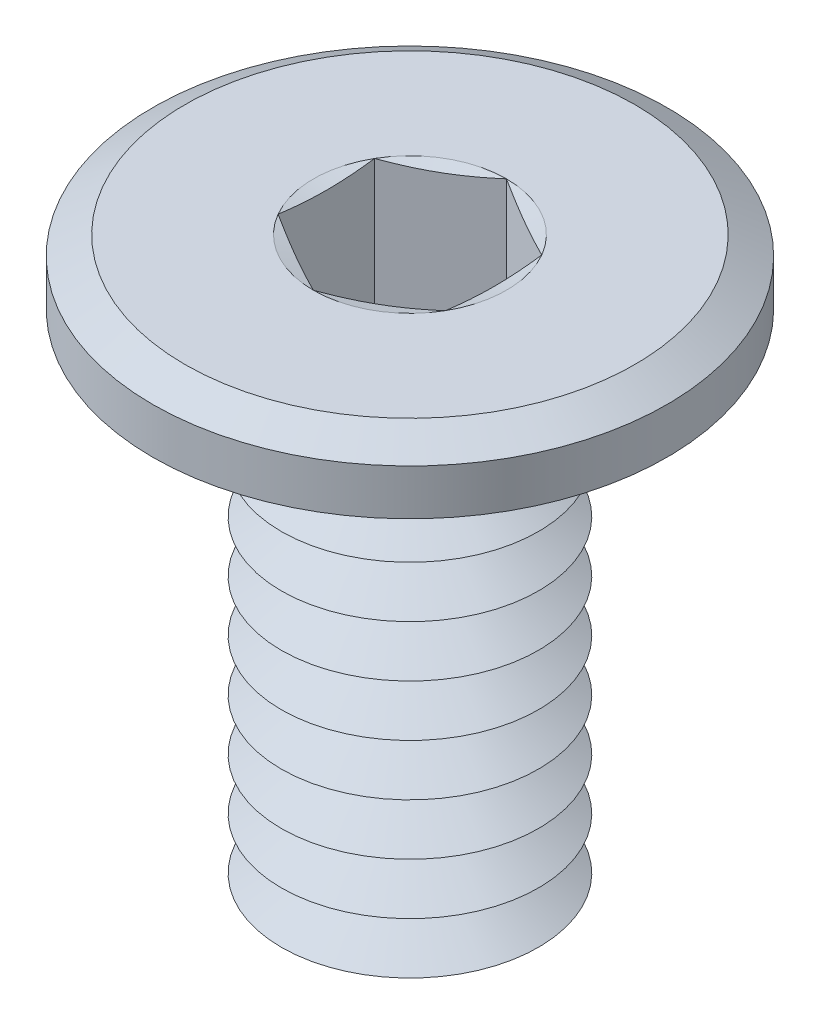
ISO-10303-21;
HEADER;
FILE_DESCRIPTION(('STEP AP214'),'2;1');
FILE_NAME('part.step','',(''),(''),'','','');
FILE_SCHEMA(('AUTOMOTIVE_DESIGN { 1 0 10303 214 1 1 1 1 }'));
ENDSEC;
DATA;
#1=APPLICATION_CONTEXT('core data for automotive mechanical design processes');
#2=APPLICATION_PROTOCOL_DEFINITION('international standard','automotive_design',2000,#1);
#3=PRODUCT_CONTEXT('',#1,'mechanical');
#4=PRODUCT('Part','Part','',(#3));
#5=PRODUCT_RELATED_PRODUCT_CATEGORY('part','',(#4));
#6=PRODUCT_DEFINITION_FORMATION('','',#4);
#7=PRODUCT_DEFINITION_CONTEXT('part definition',#1,'design');
#8=PRODUCT_DEFINITION('design','',#6,#7);
#9=PRODUCT_DEFINITION_SHAPE('','',#8);
#10=(LENGTH_UNIT() NAMED_UNIT(*) SI_UNIT(.MILLI.,.METRE.));
#11=(NAMED_UNIT(*) PLANE_ANGLE_UNIT() SI_UNIT($,.RADIAN.));
#12=(NAMED_UNIT(*) SI_UNIT($,.STERADIAN.) SOLID_ANGLE_UNIT());
#13=UNCERTAINTY_MEASURE_WITH_UNIT(LENGTH_MEASURE(1.E-05),#10,'distance_accuracy_value','');
#14=(GEOMETRIC_REPRESENTATION_CONTEXT(3) GLOBAL_UNCERTAINTY_ASSIGNED_CONTEXT((#13)) GLOBAL_UNIT_ASSIGNED_CONTEXT((#10,
#11,#12)) REPRESENTATION_CONTEXT('',''));
#15=CARTESIAN_POINT('',(0.,0.,0.));
#16=DIRECTION('',(0.,0.,1.));
#17=DIRECTION('',(1.,0.,0.));
#18=AXIS2_PLACEMENT_3D('',#15,#16,#17);
#19=CARTESIAN_POINT('',(0.,-3.9,0.));
#20=DIRECTION('',(0.,-1.,0.));
#21=DIRECTION('',(0.,0.,-1.));
#22=AXIS2_PLACEMENT_3D('',#19,#20,#21);
#23=CONICAL_SURFACE('',#22,1.,1.0471975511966);
#24=CARTESIAN_POINT('',(0.,-3.7,0.));
#25=DIRECTION('',(0.,1.,0.));
#26=DIRECTION('',(0.,0.,1.));
#27=AXIS2_PLACEMENT_3D('',#24,#25,#26);
#28=CIRCLE('',#27,0.653589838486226);
#29=CARTESIAN_POINT('',(0.,-3.7,0.653589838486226));
#30=VERTEX_POINT('',#29);
#31=EDGE_CURVE('E425',#30,#30,#28,.T.);
#32=ORIENTED_EDGE('',*,*,#31,.F.);
#33=EDGE_LOOP('',(#32));
#34=FACE_BOUND('',#33,.T.);
#35=CARTESIAN_POINT('',(0.,-3.9,0.));
#36=DIRECTION('',(0.,1.,0.));
#37=DIRECTION('',(0.,0.,1.));
#38=AXIS2_PLACEMENT_3D('',#35,#36,#37);
#39=CIRCLE('',#38,1.);
#40=CARTESIAN_POINT('',(0.,-3.9,1.));
#41=VERTEX_POINT('',#40);
#42=EDGE_CURVE('E428',#41,#41,#39,.T.);
#43=ORIENTED_EDGE('',*,*,#42,.T.);
#44=EDGE_LOOP('',(#43));
#45=FACE_BOUND('',#44,.T.);
#46=ADVANCED_FACE('F39',(#34,#45),#23,.T.);
#47=CARTESIAN_POINT('',(0.,-3.7,0.));
#48=DIRECTION('',(0.,1.,0.));
#49=DIRECTION('',(0.,0.,1.));
#50=AXIS2_PLACEMENT_3D('',#47,#48,#49);
#51=CONICAL_SURFACE('',#50,0.653589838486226,1.0471975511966);
#52=CARTESIAN_POINT('',(0.,-3.5,0.));
#53=DIRECTION('',(0.,1.,0.));
#54=DIRECTION('',(0.,0.,1.));
#55=AXIS2_PLACEMENT_3D('',#52,#53,#54);
#56=CIRCLE('',#55,1.);
#57=CARTESIAN_POINT('',(0.,-3.5,1.));
#58=VERTEX_POINT('',#57);
#59=EDGE_CURVE('E421',#58,#58,#56,.T.);
#60=ORIENTED_EDGE('',*,*,#59,.F.);
#61=EDGE_LOOP('',(#60));
#62=FACE_BOUND('',#61,.T.);
#63=ORIENTED_EDGE('',*,*,#31,.T.);
#64=EDGE_LOOP('',(#63));
#65=FACE_BOUND('',#64,.T.);
#66=ADVANCED_FACE('F233',(#62,#65),#51,.T.);
#67=CARTESIAN_POINT('',(0.,-4.5,0.));
#68=DIRECTION('',(0.,-1.,0.));
#69=DIRECTION('',(0.,0.,-1.));
#70=AXIS2_PLACEMENT_3D('',#67,#68,#69);
#71=PLANE('',#70);
#72=CARTESIAN_POINT('',(0.,-4.5,0.));
#73=DIRECTION('',(0.,1.,0.));
#74=DIRECTION('',(0.,0.,1.));
#75=AXIS2_PLACEMENT_3D('',#72,#73,#74);
#76=CIRCLE('',#75,0.653589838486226);
#77=CARTESIAN_POINT('',(0.,-4.5,0.653589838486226));
#78=VERTEX_POINT('',#77);
#79=EDGE_CURVE('E299',#78,#78,#76,.T.);
#80=ORIENTED_EDGE('',*,*,#79,.F.);
#81=EDGE_LOOP('',(#80));
#82=FACE_BOUND('',#81,.T.);
#83=ADVANCED_FACE('F239',(#82),#71,.T.);
#84=CARTESIAN_POINT('',(0.,-4.5,0.));
#85=DIRECTION('',(0.,1.,0.));
#86=DIRECTION('',(0.,0.,1.));
#87=AXIS2_PLACEMENT_3D('',#84,#85,#86);
#88=CONICAL_SURFACE('',#87,0.653589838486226,1.0471975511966);
#89=CARTESIAN_POINT('',(0.,-4.3,0.));
#90=DIRECTION('',(0.,1.,0.));
#91=DIRECTION('',(0.,0.,1.));
#92=AXIS2_PLACEMENT_3D('',#89,#90,#91);
#93=CIRCLE('',#92,1.);
#94=CARTESIAN_POINT('',(0.,-4.3,1.));
#95=VERTEX_POINT('',#94);
#96=EDGE_CURVE('E436',#95,#95,#93,.T.);
#97=ORIENTED_EDGE('',*,*,#96,.F.);
#98=EDGE_LOOP('',(#97));
#99=FACE_BOUND('',#98,.T.);
#100=ORIENTED_EDGE('',*,*,#79,.T.);
#101=EDGE_LOOP('',(#100));
#102=FACE_BOUND('',#101,.T.);
#103=ADVANCED_FACE('F254',(#99,#102),#88,.T.);
#104=CARTESIAN_POINT('',(0.,-4.3,0.));
#105=DIRECTION('',(0.,-1.,0.));
#106=DIRECTION('',(0.,0.,-1.));
#107=AXIS2_PLACEMENT_3D('',#104,#105,#106);
#108=CONICAL_SURFACE('',#107,1.,1.0471975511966);
#109=CARTESIAN_POINT('',(0.,-4.1,0.));
#110=DIRECTION('',(0.,1.,0.));
#111=DIRECTION('',(0.,0.,1.));
#112=AXIS2_PLACEMENT_3D('',#109,#110,#111);
#113=CIRCLE('',#112,0.653589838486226);
#114=CARTESIAN_POINT('',(0.,-4.1,0.653589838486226));
#115=VERTEX_POINT('',#114);
#116=EDGE_CURVE('E432',#115,#115,#113,.T.);
#117=ORIENTED_EDGE('',*,*,#116,.F.);
#118=EDGE_LOOP('',(#117));
#119=FACE_BOUND('',#118,.T.);
#120=ORIENTED_EDGE('',*,*,#96,.T.);
#121=EDGE_LOOP('',(#120));
#122=FACE_BOUND('',#121,.T.);
#123=ADVANCED_FACE('F250',(#119,#122),#108,.T.);
#124=CARTESIAN_POINT('',(0.,-4.1,0.));
#125=DIRECTION('',(0.,1.,0.));
#126=DIRECTION('',(0.,0.,1.));
#127=AXIS2_PLACEMENT_3D('',#124,#125,#126);
#128=CONICAL_SURFACE('',#127,0.653589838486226,1.0471975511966);
#129=ORIENTED_EDGE('',*,*,#42,.F.);
#130=EDGE_LOOP('',(#129));
#131=FACE_BOUND('',#130,.T.);
#132=ORIENTED_EDGE('',*,*,#116,.T.);
#133=EDGE_LOOP('',(#132));
#134=FACE_BOUND('',#133,.T.);
#135=ADVANCED_FACE('F246',(#131,#134),#128,.T.);
#136=CARTESIAN_POINT('',(0.,-3.5,0.));
#137=DIRECTION('',(0.,-1.,0.));
#138=DIRECTION('',(0.,0.,-1.));
#139=AXIS2_PLACEMENT_3D('',#136,#137,#138);
#140=CONICAL_SURFACE('',#139,1.,1.0471975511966);
#141=CARTESIAN_POINT('',(0.,-3.3,0.));
#142=DIRECTION('',(0.,1.,0.));
#143=DIRECTION('',(0.,0.,1.));
#144=AXIS2_PLACEMENT_3D('',#141,#142,#143);
#145=CIRCLE('',#144,0.653589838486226);
#146=CARTESIAN_POINT('',(0.,-3.3,0.653589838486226));
#147=VERTEX_POINT('',#146);
#148=EDGE_CURVE('E417',#147,#147,#145,.T.);
#149=ORIENTED_EDGE('',*,*,#148,.F.);
#150=EDGE_LOOP('',(#149));
#151=FACE_BOUND('',#150,.T.);
#152=ORIENTED_EDGE('',*,*,#59,.T.);
#153=EDGE_LOOP('',(#152));
#154=FACE_BOUND('',#153,.T.);
#155=ADVANCED_FACE('F249',(#151,#154),#140,.T.);
#156=CARTESIAN_POINT('',(0.,-3.3,0.));
#157=DIRECTION('',(0.,1.,0.));
#158=DIRECTION('',(0.,0.,1.));
#159=AXIS2_PLACEMENT_3D('',#156,#157,#158);
#160=CONICAL_SURFACE('',#159,0.653589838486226,1.0471975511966);
#161=CARTESIAN_POINT('',(0.,-3.1,0.));
#162=DIRECTION('',(0.,1.,0.));
#163=DIRECTION('',(0.,0.,1.));
#164=AXIS2_PLACEMENT_3D('',#161,#162,#163);
#165=CIRCLE('',#164,1.);
#166=CARTESIAN_POINT('',(0.,-3.1,1.));
#167=VERTEX_POINT('',#166);
#168=EDGE_CURVE('E413',#167,#167,#165,.T.);
#169=ORIENTED_EDGE('',*,*,#168,.F.);
#170=EDGE_LOOP('',(#169));
#171=FACE_BOUND('',#170,.T.);
#172=ORIENTED_EDGE('',*,*,#148,.T.);
#173=EDGE_LOOP('',(#172));
#174=FACE_BOUND('',#173,.T.);
#175=ADVANCED_FACE('F640',(#171,#174),#160,.T.);
#176=CARTESIAN_POINT('',(0.,-3.1,0.));
#177=DIRECTION('',(0.,-1.,0.));
#178=DIRECTION('',(0.,0.,-1.));
#179=AXIS2_PLACEMENT_3D('',#176,#177,#178);
#180=CONICAL_SURFACE('',#179,1.,1.0471975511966);
#181=CARTESIAN_POINT('',(0.,-2.9,0.));
#182=DIRECTION('',(0.,1.,0.));
#183=DIRECTION('',(0.,0.,1.));
#184=AXIS2_PLACEMENT_3D('',#181,#182,#183);
#185=CIRCLE('',#184,0.653589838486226);
#186=CARTESIAN_POINT('',(0.,-2.9,0.653589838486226));
#187=VERTEX_POINT('',#186);
#188=EDGE_CURVE('E409',#187,#187,#185,.T.);
#189=ORIENTED_EDGE('',*,*,#188,.F.);
#190=EDGE_LOOP('',(#189));
#191=FACE_BOUND('',#190,.T.);
#192=ORIENTED_EDGE('',*,*,#168,.T.);
#193=EDGE_LOOP('',(#192));
#194=FACE_BOUND('',#193,.T.);
#195=ADVANCED_FACE('F631',(#191,#194),#180,.T.);
#196=CARTESIAN_POINT('',(0.,-2.9,0.));
#197=DIRECTION('',(0.,1.,0.));
#198=DIRECTION('',(0.,0.,1.));
#199=AXIS2_PLACEMENT_3D('',#196,#197,#198);
#200=CONICAL_SURFACE('',#199,0.653589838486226,1.0471975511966);
#201=CARTESIAN_POINT('',(0.,-2.7,0.));
#202=DIRECTION('',(0.,1.,0.));
#203=DIRECTION('',(0.,0.,1.));
#204=AXIS2_PLACEMENT_3D('',#201,#202,#203);
#205=CIRCLE('',#204,1.);
#206=CARTESIAN_POINT('',(0.,-2.7,1.));
#207=VERTEX_POINT('',#206);
#208=EDGE_CURVE('E405',#207,#207,#205,.T.);
#209=ORIENTED_EDGE('',*,*,#208,.F.);
#210=EDGE_LOOP('',(#209));
#211=FACE_BOUND('',#210,.T.);
#212=ORIENTED_EDGE('',*,*,#188,.T.);
#213=EDGE_LOOP('',(#212));
#214=FACE_BOUND('',#213,.T.);
#215=ADVANCED_FACE('F622',(#211,#214),#200,.T.);
#216=CARTESIAN_POINT('',(0.,-2.7,0.));
#217=DIRECTION('',(0.,-1.,0.));
#218=DIRECTION('',(0.,0.,-1.));
#219=AXIS2_PLACEMENT_3D('',#216,#217,#218);
#220=CONICAL_SURFACE('',#219,1.,1.0471975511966);
#221=CARTESIAN_POINT('',(0.,-2.5,0.));
#222=DIRECTION('',(0.,1.,0.));
#223=DIRECTION('',(0.,0.,1.));
#224=AXIS2_PLACEMENT_3D('',#221,#222,#223);
#225=CIRCLE('',#224,0.653589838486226);
#226=CARTESIAN_POINT('',(0.,-2.5,0.653589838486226));
#227=VERTEX_POINT('',#226);
#228=EDGE_CURVE('E401',#227,#227,#225,.T.);
#229=ORIENTED_EDGE('',*,*,#228,.F.);
#230=EDGE_LOOP('',(#229));
#231=FACE_BOUND('',#230,.T.);
#232=ORIENTED_EDGE('',*,*,#208,.T.);
#233=EDGE_LOOP('',(#232));
#234=FACE_BOUND('',#233,.T.);
#235=ADVANCED_FACE('F613',(#231,#234),#220,.T.);
#236=CARTESIAN_POINT('',(0.,-2.5,0.));
#237=DIRECTION('',(0.,1.,0.));
#238=DIRECTION('',(0.,0.,1.));
#239=AXIS2_PLACEMENT_3D('',#236,#237,#238);
#240=CONICAL_SURFACE('',#239,0.653589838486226,1.0471975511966);
#241=CARTESIAN_POINT('',(0.,-2.3,0.));
#242=DIRECTION('',(0.,1.,0.));
#243=DIRECTION('',(0.,0.,1.));
#244=AXIS2_PLACEMENT_3D('',#241,#242,#243);
#245=CIRCLE('',#244,1.);
#246=CARTESIAN_POINT('',(0.,-2.3,1.));
#247=VERTEX_POINT('',#246);
#248=EDGE_CURVE('E398',#247,#247,#245,.T.);
#249=ORIENTED_EDGE('',*,*,#248,.F.);
#250=EDGE_LOOP('',(#249));
#251=FACE_BOUND('',#250,.T.);
#252=ORIENTED_EDGE('',*,*,#228,.T.);
#253=EDGE_LOOP('',(#252));
#254=FACE_BOUND('',#253,.T.);
#255=ADVANCED_FACE('F604',(#251,#254),#240,.T.);
#256=CARTESIAN_POINT('',(0.,-2.3,0.));
#257=DIRECTION('',(0.,-1.,0.));
#258=DIRECTION('',(0.,0.,-1.));
#259=AXIS2_PLACEMENT_3D('',#256,#257,#258);
#260=CONICAL_SURFACE('',#259,1.,1.0471975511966);
#261=CARTESIAN_POINT('',(0.,-2.1,0.));
#262=DIRECTION('',(0.,1.,0.));
#263=DIRECTION('',(0.,0.,1.));
#264=AXIS2_PLACEMENT_3D('',#261,#262,#263);
#265=CIRCLE('',#264,0.653589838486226);
#266=CARTESIAN_POINT('',(0.,-2.1,0.653589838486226));
#267=VERTEX_POINT('',#266);
#268=EDGE_CURVE('E394',#267,#267,#265,.T.);
#269=ORIENTED_EDGE('',*,*,#268,.F.);
#270=EDGE_LOOP('',(#269));
#271=FACE_BOUND('',#270,.T.);
#272=ORIENTED_EDGE('',*,*,#248,.T.);
#273=EDGE_LOOP('',(#272));
#274=FACE_BOUND('',#273,.T.);
#275=ADVANCED_FACE('F595',(#271,#274),#260,.T.);
#276=CARTESIAN_POINT('',(0.,-2.1,0.));
#277=DIRECTION('',(0.,1.,0.));
#278=DIRECTION('',(0.,0.,1.));
#279=AXIS2_PLACEMENT_3D('',#276,#277,#278);
#280=CONICAL_SURFACE('',#279,0.653589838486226,1.0471975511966);
#281=CARTESIAN_POINT('',(0.,-1.9,0.));
#282=DIRECTION('',(0.,1.,0.));
#283=DIRECTION('',(0.,0.,1.));
#284=AXIS2_PLACEMENT_3D('',#281,#282,#283);
#285=CIRCLE('',#284,1.);
#286=CARTESIAN_POINT('',(0.,-1.9,1.));
#287=VERTEX_POINT('',#286);
#288=EDGE_CURVE('E390',#287,#287,#285,.T.);
#289=ORIENTED_EDGE('',*,*,#288,.F.);
#290=EDGE_LOOP('',(#289));
#291=FACE_BOUND('',#290,.T.);
#292=ORIENTED_EDGE('',*,*,#268,.T.);
#293=EDGE_LOOP('',(#292));
#294=FACE_BOUND('',#293,.T.);
#295=ADVANCED_FACE('F586',(#291,#294),#280,.T.);
#296=CARTESIAN_POINT('',(0.,-1.9,0.));
#297=DIRECTION('',(0.,-1.,0.));
#298=DIRECTION('',(0.,0.,-1.));
#299=AXIS2_PLACEMENT_3D('',#296,#297,#298);
#300=CONICAL_SURFACE('',#299,1.,1.0471975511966);
#301=CARTESIAN_POINT('',(0.,-1.7,0.));
#302=DIRECTION('',(0.,1.,0.));
#303=DIRECTION('',(0.,0.,1.));
#304=AXIS2_PLACEMENT_3D('',#301,#302,#303);
#305=CIRCLE('',#304,0.653589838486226);
#306=CARTESIAN_POINT('',(0.,-1.7,0.653589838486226));
#307=VERTEX_POINT('',#306);
#308=EDGE_CURVE('E386',#307,#307,#305,.T.);
#309=ORIENTED_EDGE('',*,*,#308,.F.);
#310=EDGE_LOOP('',(#309));
#311=FACE_BOUND('',#310,.T.);
#312=ORIENTED_EDGE('',*,*,#288,.T.);
#313=EDGE_LOOP('',(#312));
#314=FACE_BOUND('',#313,.T.);
#315=ADVANCED_FACE('F577',(#311,#314),#300,.T.);
#316=CARTESIAN_POINT('',(0.,-1.7,0.));
#317=DIRECTION('',(0.,1.,0.));
#318=DIRECTION('',(0.,0.,1.));
#319=AXIS2_PLACEMENT_3D('',#316,#317,#318);
#320=CONICAL_SURFACE('',#319,0.653589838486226,1.0471975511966);
#321=CARTESIAN_POINT('',(0.,-1.5,0.));
#322=DIRECTION('',(0.,1.,0.));
#323=DIRECTION('',(0.,0.,1.));
#324=AXIS2_PLACEMENT_3D('',#321,#322,#323);
#325=CIRCLE('',#324,1.);
#326=CARTESIAN_POINT('',(0.,-1.5,1.));
#327=VERTEX_POINT('',#326);
#328=EDGE_CURVE('E382',#327,#327,#325,.T.);
#329=ORIENTED_EDGE('',*,*,#328,.F.);
#330=EDGE_LOOP('',(#329));
#331=FACE_BOUND('',#330,.T.);
#332=ORIENTED_EDGE('',*,*,#308,.T.);
#333=EDGE_LOOP('',(#332));
#334=FACE_BOUND('',#333,.T.);
#335=ADVANCED_FACE('F568',(#331,#334),#320,.T.);
#336=CARTESIAN_POINT('',(0.,-1.5,0.));
#337=DIRECTION('',(0.,-1.,0.));
#338=DIRECTION('',(0.,0.,-1.));
#339=AXIS2_PLACEMENT_3D('',#336,#337,#338);
#340=CONICAL_SURFACE('',#339,1.,1.0471975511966);
#341=CARTESIAN_POINT('',(0.,-1.3,0.));
#342=DIRECTION('',(0.,1.,0.));
#343=DIRECTION('',(0.,0.,1.));
#344=AXIS2_PLACEMENT_3D('',#341,#342,#343);
#345=CIRCLE('',#344,0.653589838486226);
#346=CARTESIAN_POINT('',(0.,-1.3,0.653589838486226));
#347=VERTEX_POINT('',#346);
#348=EDGE_CURVE('E378',#347,#347,#345,.T.);
#349=ORIENTED_EDGE('',*,*,#348,.F.);
#350=EDGE_LOOP('',(#349));
#351=FACE_BOUND('',#350,.T.);
#352=ORIENTED_EDGE('',*,*,#328,.T.);
#353=EDGE_LOOP('',(#352));
#354=FACE_BOUND('',#353,.T.);
#355=ADVANCED_FACE('F559',(#351,#354),#340,.T.);
#356=CARTESIAN_POINT('',(0.,-1.3,0.));
#357=DIRECTION('',(0.,1.,0.));
#358=DIRECTION('',(0.,0.,1.));
#359=AXIS2_PLACEMENT_3D('',#356,#357,#358);
#360=CONICAL_SURFACE('',#359,0.653589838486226,1.0471975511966);
#361=CARTESIAN_POINT('',(0.,-1.1,0.));
#362=DIRECTION('',(0.,1.,0.));
#363=DIRECTION('',(0.,0.,1.));
#364=AXIS2_PLACEMENT_3D('',#361,#362,#363);
#365=CIRCLE('',#364,1.);
#366=CARTESIAN_POINT('',(0.,-1.1,1.));
#367=VERTEX_POINT('',#366);
#368=EDGE_CURVE('E362',#367,#367,#365,.T.);
#369=ORIENTED_EDGE('',*,*,#368,.F.);
#370=EDGE_LOOP('',(#369));
#371=FACE_BOUND('',#370,.T.);
#372=ORIENTED_EDGE('',*,*,#348,.T.);
#373=EDGE_LOOP('',(#372));
#374=FACE_BOUND('',#373,.T.);
#375=ADVANCED_FACE('F274',(#371,#374),#360,.T.);
#376=CARTESIAN_POINT('',(0.,0.,0.));
#377=DIRECTION('',(0.,1.,0.));
#378=DIRECTION('',(0.,0.,1.));
#379=AXIS2_PLACEMENT_3D('',#376,#377,#378);
#380=PLANE('',#379);
#381=CARTESIAN_POINT('',(0.,0.,0.));
#382=DIRECTION('',(0.,1.,0.));
#383=DIRECTION('',(0.,0.,1.));
#384=AXIS2_PLACEMENT_3D('',#381,#382,#383);
#385=CIRCLE('',#384,0.750555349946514);
#386=CARTESIAN_POINT('',(0.,0.,0.750555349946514));
#387=VERTEX_POINT('',#386);
#388=CARTESIAN_POINT('',(0.65,0.,0.375277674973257));
#389=VERTEX_POINT('',#388);
#390=EDGE_CURVE('E66',#387,#389,#385,.T.);
#391=ORIENTED_EDGE('',*,*,#390,.F.);
#392=CARTESIAN_POINT('',(-0.65,0.,0.375277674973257));
#393=VERTEX_POINT('',#392);
#394=EDGE_CURVE('E169',#393,#387,#385,.T.);
#395=ORIENTED_EDGE('',*,*,#394,.F.);
#396=CARTESIAN_POINT('',(-0.65,0.,-0.375277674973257));
#397=VERTEX_POINT('',#396);
#398=EDGE_CURVE('E164',#397,#393,#385,.T.);
#399=ORIENTED_EDGE('',*,*,#398,.F.);
#400=CARTESIAN_POINT('',(0.,0.,-0.750555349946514));
#401=VERTEX_POINT('',#400);
#402=EDGE_CURVE('E128',#401,#397,#385,.T.);
#403=ORIENTED_EDGE('',*,*,#402,.F.);
#404=CARTESIAN_POINT('',(0.65,0.,-0.375277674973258));
#405=VERTEX_POINT('',#404);
#406=EDGE_CURVE('E119',#405,#401,#385,.T.);
#407=ORIENTED_EDGE('',*,*,#406,.F.);
#408=EDGE_CURVE('E59',#389,#405,#385,.T.);
#409=ORIENTED_EDGE('',*,*,#408,.F.);
#410=EDGE_LOOP('',(#391,#395,#399,#403,#407,#409));
#411=FACE_BOUND('',#410,.T.);
#412=CARTESIAN_POINT('',(0.,0.,0.));
#413=DIRECTION('',(0.,1.,0.));
#414=DIRECTION('',(0.,0.,1.));
#415=AXIS2_PLACEMENT_3D('',#412,#413,#414);
#416=CIRCLE('',#415,1.75);
#417=CARTESIAN_POINT('',(0.,0.,1.75));
#418=VERTEX_POINT('',#417);
#419=EDGE_CURVE('E295',#418,#418,#416,.T.);
#420=ORIENTED_EDGE('',*,*,#419,.T.);
#421=EDGE_LOOP('',(#420));
#422=FACE_BOUND('',#421,.T.);
#423=ADVANCED_FACE('F160',(#411,#422),#380,.T.);
#424=CARTESIAN_POINT('',(0.,-0.5,0.));
#425=DIRECTION('',(0.,1.,0.));
#426=DIRECTION('',(0.,0.,1.));
#427=AXIS2_PLACEMENT_3D('',#424,#425,#426);
#428=CYLINDRICAL_SURFACE('',#427,2.);
#429=CARTESIAN_POINT('',(0.,-0.144337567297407,0.));
#430=DIRECTION('',(0.,1.,0.));
#431=DIRECTION('',(0.,0.,1.));
#432=AXIS2_PLACEMENT_3D('',#429,#430,#431);
#433=CIRCLE('',#432,2.);
#434=CARTESIAN_POINT('',(0.,-0.144337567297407,2.));
#435=VERTEX_POINT('',#434);
#436=EDGE_CURVE('E306',#435,#435,#433,.F.);
#437=ORIENTED_EDGE('',*,*,#436,.T.);
#438=EDGE_LOOP('',(#437));
#439=FACE_BOUND('',#438,.T.);
#440=CARTESIAN_POINT('',(0.,-0.5,0.));
#441=DIRECTION('',(0.,1.,0.));
#442=DIRECTION('',(0.,0.,1.));
#443=AXIS2_PLACEMENT_3D('',#440,#441,#442);
#444=CIRCLE('',#443,2.);
#445=CARTESIAN_POINT('',(0.,-0.5,2.));
#446=VERTEX_POINT('',#445);
#447=EDGE_CURVE('E291',#446,#446,#444,.T.);
#448=ORIENTED_EDGE('',*,*,#447,.T.);
#449=EDGE_LOOP('',(#448));
#450=FACE_BOUND('',#449,.T.);
#451=ADVANCED_FACE('F270',(#439,#450),#428,.T.);
#452=CARTESIAN_POINT('',(0.,-0.5,0.));
#453=DIRECTION('',(0.,1.,0.));
#454=DIRECTION('',(0.,0.,1.));
#455=AXIS2_PLACEMENT_3D('',#452,#453,#454);
#456=PLANE('',#455);
#457=CARTESIAN_POINT('',(0.,-0.5,0.));
#458=DIRECTION('',(0.,1.,0.));
#459=DIRECTION('',(0.,0.,1.));
#460=AXIS2_PLACEMENT_3D('',#457,#458,#459);
#461=CIRCLE('',#460,1.1);
#462=CARTESIAN_POINT('',(0.,-0.5,1.1));
#463=VERTEX_POINT('',#462);
#464=EDGE_CURVE('E286',#463,#463,#461,.T.);
#465=ORIENTED_EDGE('',*,*,#464,.T.);
#466=EDGE_LOOP('',(#465));
#467=FACE_BOUND('',#466,.T.);
#468=ORIENTED_EDGE('',*,*,#447,.F.);
#469=EDGE_LOOP('',(#468));
#470=FACE_BOUND('',#469,.T.);
#471=ADVANCED_FACE('F266',(#467,#470),#456,.F.);
#472=CARTESIAN_POINT('',(0.,-4.5,0.));
#473=DIRECTION('',(0.,1.,0.));
#474=DIRECTION('',(0.,0.,1.));
#475=AXIS2_PLACEMENT_3D('',#472,#473,#474);
#476=CYLINDRICAL_SURFACE('',#475,1.);
#477=CARTESIAN_POINT('',(0.,-0.6,0.));
#478=DIRECTION('',(0.,1.,0.));
#479=DIRECTION('',(0.,0.,1.));
#480=AXIS2_PLACEMENT_3D('',#477,#478,#479);
#481=CIRCLE('',#480,1.);
#482=CARTESIAN_POINT('',(0.,-0.6,1.));
#483=VERTEX_POINT('',#482);
#484=EDGE_CURVE('E289',#483,#483,#481,.F.);
#485=ORIENTED_EDGE('',*,*,#484,.T.);
#486=EDGE_LOOP('',(#485));
#487=FACE_BOUND('',#486,.T.);
#488=ORIENTED_EDGE('',*,*,#368,.T.);
#489=EDGE_LOOP('',(#488));
#490=FACE_BOUND('',#489,.T.);
#491=ADVANCED_FACE('F262',(#487,#490),#476,.T.);
#492=CARTESIAN_POINT('',(0.,-0.6,0.));
#493=DIRECTION('',(0.,1.,0.));
#494=DIRECTION('',(0.,0.,1.));
#495=AXIS2_PLACEMENT_3D('',#492,#493,#494);
#496=TOROIDAL_SURFACE('',#495,1.1,0.1);
#497=ORIENTED_EDGE('',*,*,#464,.F.);
#498=EDGE_LOOP('',(#497));
#499=FACE_BOUND('',#498,.T.);
#500=ORIENTED_EDGE('',*,*,#484,.F.);
#501=EDGE_LOOP('',(#500));
#502=FACE_BOUND('',#501,.T.);
#503=ADVANCED_FACE('F265',(#499,#502),#496,.F.);
#504=CARTESIAN_POINT('',(0.,0.,0.));
#505=DIRECTION('',(0.,-1.,0.));
#506=DIRECTION('',(0.,0.,-1.));
#507=AXIS2_PLACEMENT_3D('',#504,#505,#506);
#508=CONICAL_SURFACE('',#507,1.75,1.0471975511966);
#509=ORIENTED_EDGE('',*,*,#436,.F.);
#510=EDGE_LOOP('',(#509));
#511=FACE_BOUND('',#510,.T.);
#512=ORIENTED_EDGE('',*,*,#419,.F.);
#513=EDGE_LOOP('',(#512));
#514=FACE_BOUND('',#513,.T.);
#515=ADVANCED_FACE('F41',(#511,#514),#508,.T.);
#516=CARTESIAN_POINT('',(0.,0.,0.));
#517=DIRECTION('',(0.,1.,0.));
#518=DIRECTION('',(0.,0.,1.));
#519=AXIS2_PLACEMENT_3D('',#516,#517,#518);
#520=CONICAL_SURFACE('',#519,0.750555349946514,1.30899693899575);
#521=ORIENTED_EDGE('',*,*,#402,.T.);
#522=CARTESIAN_POINT('',(0.000200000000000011,3.09472466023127E-05,-0.750670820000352));
#523=CARTESIAN_POINT('',(-0.0268094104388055,-0.00415092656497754,-0.735076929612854));
#524=CARTESIAN_POINT('',(-0.0538678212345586,-0.00794750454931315,-0.719454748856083));
#525=CARTESIAN_POINT('',(-0.108080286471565,-0.0146178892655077,-0.688155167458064));
#526=CARTESIAN_POINT('',(-0.135234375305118,-0.0174913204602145,-0.672477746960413));
#527=CARTESIAN_POINT('',(-0.18947340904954,-0.0221475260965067,-0.641162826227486));
#528=CARTESIAN_POINT('',(-0.216557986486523,-0.0239358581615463,-0.625525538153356));
#529=CARTESIAN_POINT('',(-0.270761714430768,-0.0263338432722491,-0.594231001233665));
#530=CARTESIAN_POINT('',(-0.297880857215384,-0.0269437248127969,-0.578573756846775));
#531=CARTESIAN_POINT('',(-0.352119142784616,-0.0269437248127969,-0.547259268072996));
#532=CARTESIAN_POINT('',(-0.379238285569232,-0.0263338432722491,-0.531602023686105));
#533=CARTESIAN_POINT('',(-0.433442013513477,-0.0239358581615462,-0.500307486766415));
#534=CARTESIAN_POINT('',(-0.460526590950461,-0.0221475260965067,-0.484670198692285));
#535=CARTESIAN_POINT('',(-0.514765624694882,-0.0174913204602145,-0.453355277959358));
#536=CARTESIAN_POINT('',(-0.541919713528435,-0.0146178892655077,-0.437677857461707));
#537=CARTESIAN_POINT('',(-0.596132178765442,-0.00794750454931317,-0.406378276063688));
#538=CARTESIAN_POINT('',(-0.623190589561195,-0.00415092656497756,-0.390756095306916));
#539=CARTESIAN_POINT('',(-0.6502,3.09472466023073E-05,-0.375162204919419));
#540=B_SPLINE_CURVE_WITH_KNOTS('',3,(#522,#523,#524,#525,#526,#527,#528,#529,#530,#531,#532,
#533,#534,#535,#536,#537,#538,#539),.UNSPECIFIED.,.F.,.F.,(4,2,2,2,2,2,2,2,4),(0.,
0.0944056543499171,0.188849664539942,0.282805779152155,0.376743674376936,0.470681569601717,
0.564637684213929,0.659081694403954,0.753487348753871),.UNSPECIFIED.);
#541=EDGE_CURVE('E11',#401,#397,#540,.T.);
#542=ORIENTED_EDGE('',*,*,#541,.F.);
#543=EDGE_LOOP('',(#521,#542));
#544=FACE_BOUND('',#543,.T.);
#545=ADVANCED_FACE('F132',(#544),#520,.F.);
#546=ORIENTED_EDGE('',*,*,#398,.T.);
#547=CARTESIAN_POINT('',(-0.65,0.153431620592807,-1.15250975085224));
#548=CARTESIAN_POINT('',(-0.65,0.140485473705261,-1.09696292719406));
#549=CARTESIAN_POINT('',(-0.65,0.12772104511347,-1.04137089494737));
#550=CARTESIAN_POINT('',(-0.65,0.102806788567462,-0.93003898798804));
#551=CARTESIAN_POINT('',(-0.65,0.0906570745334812,-0.874299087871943));
#552=CARTESIAN_POINT('',(-0.65,0.0671143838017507,-0.762091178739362));
#553=CARTESIAN_POINT('',(-0.65,0.0557299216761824,-0.70562136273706));
#554=CARTESIAN_POINT('',(-0.65,0.0342960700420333,-0.59241870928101));
#555=CARTESIAN_POINT('',(-0.65,0.0242468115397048,-0.535685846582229));
#556=CARTESIAN_POINT('',(-0.65,0.00641278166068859,-0.423455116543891));
#557=CARTESIAN_POINT('',(-0.65,-0.00142665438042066,-0.367966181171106));
#558=CARTESIAN_POINT('',(-0.65,-0.0143371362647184,-0.256669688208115));
#559=CARTESIAN_POINT('',(-0.65,-0.0194090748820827,-0.200862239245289));
#560=CARTESIAN_POINT('',(-0.65,-0.025908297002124,-0.0892782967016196));
#561=CARTESIAN_POINT('',(-0.65,-0.0273521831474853,-0.0335028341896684));
#562=CARTESIAN_POINT('',(-0.65,-0.0263311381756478,0.078014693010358));
#563=CARTESIAN_POINT('',(-0.65,-0.0238659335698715,0.133756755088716));
#564=CARTESIAN_POINT('',(-0.65,-0.016691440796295,0.229596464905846));
#565=CARTESIAN_POINT('',(-0.65,-0.0127907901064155,0.269759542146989));
#566=CARTESIAN_POINT('',(-0.65,-0.00354681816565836,0.349915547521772));
#567=CARTESIAN_POINT('',(-0.65,0.00179646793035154,0.389908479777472));
#568=CARTESIAN_POINT('',(-0.65,0.0195190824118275,0.50990254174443));
#569=CARTESIAN_POINT('',(-0.65,0.0335668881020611,0.589653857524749));
#570=CARTESIAN_POINT('',(-0.65,0.0566589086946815,0.709742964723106));
#571=CARTESIAN_POINT('',(-0.65,0.0647873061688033,0.750268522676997));
#572=CARTESIAN_POINT('',(-0.65,0.0815416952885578,0.831218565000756));
#573=CARTESIAN_POINT('',(-0.65,0.0901676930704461,0.871643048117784));
#574=CARTESIAN_POINT('',(-0.65,0.107740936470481,0.952178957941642));
#575=CARTESIAN_POINT('',(-0.65,0.116686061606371,0.992290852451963));
#576=CARTESIAN_POINT('',(-0.65,0.134863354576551,1.07244661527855));
#577=CARTESIAN_POINT('',(-0.65,0.144095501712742,1.11249048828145));
#578=CARTESIAN_POINT('',(-0.65,0.153431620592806,1.15250975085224));
#579=B_SPLINE_CURVE_WITH_KNOTS('',3,(#547,#548,#549,#550,#551,#552,#553,#554,#555,#556,#557,
#558,#559,#560,#561,#562,#563,#564,#565,#566,#567,#568,#569,#570,#571,#572,#573,#574,#575,#576,
#577,#578),.UNSPECIFIED.,.F.,.F.,(4,2,2,2,2,2,2,2,2,2,2,2,2,2,2,4),(0.,0.171110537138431,
0.342252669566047,0.515060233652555,0.687884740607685,0.855957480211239,1.02397596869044,
1.19122416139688,1.3584840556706,1.4795115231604,1.60053604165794,1.84338230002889,
1.9673809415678,2.09138111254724,2.21467179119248,2.33795359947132),.UNSPECIFIED.);
#580=EDGE_CURVE('E172',#397,#393,#579,.T.);
#581=ORIENTED_EDGE('',*,*,#580,.F.);
#582=EDGE_LOOP('',(#546,#581));
#583=FACE_BOUND('',#582,.T.);
#584=ADVANCED_FACE('F479',(#583),#520,.F.);
#585=ORIENTED_EDGE('',*,*,#394,.T.);
#586=CARTESIAN_POINT('',(-0.6502,3.09472466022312E-05,0.375162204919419));
#587=CARTESIAN_POINT('',(-0.623190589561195,-0.0041509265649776,0.390756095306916));
#588=CARTESIAN_POINT('',(-0.596132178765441,-0.00794750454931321,0.406378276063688));
#589=CARTESIAN_POINT('',(-0.541919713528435,-0.0146178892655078,0.437677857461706));
#590=CARTESIAN_POINT('',(-0.514765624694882,-0.0174913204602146,0.453355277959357));
#591=CARTESIAN_POINT('',(-0.460526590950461,-0.0221475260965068,0.484670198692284));
#592=CARTESIAN_POINT('',(-0.433442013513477,-0.0239358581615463,0.500307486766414));
#593=CARTESIAN_POINT('',(-0.379238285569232,-0.0263338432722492,0.531602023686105));
#594=CARTESIAN_POINT('',(-0.352119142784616,-0.026943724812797,0.547259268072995));
#595=CARTESIAN_POINT('',(-0.297880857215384,-0.026943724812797,0.578573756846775));
#596=CARTESIAN_POINT('',(-0.270761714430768,-0.0263338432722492,0.594231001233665));
#597=CARTESIAN_POINT('',(-0.216557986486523,-0.0239358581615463,0.625525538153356));
#598=CARTESIAN_POINT('',(-0.18947340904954,-0.0221475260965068,0.641162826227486));
#599=CARTESIAN_POINT('',(-0.135234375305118,-0.0174913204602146,0.672477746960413));
#600=CARTESIAN_POINT('',(-0.108080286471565,-0.0146178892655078,0.688155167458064));
#601=CARTESIAN_POINT('',(-0.0538678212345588,-0.00794750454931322,0.719454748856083));
#602=CARTESIAN_POINT('',(-0.0268094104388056,-0.0041509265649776,0.735076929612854));
#603=CARTESIAN_POINT('',(0.000199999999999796,3.09472466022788E-05,0.750670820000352));
#604=B_SPLINE_CURVE_WITH_KNOTS('',3,(#586,#587,#588,#589,#590,#591,#592,#593,#594,#595,#596,
#597,#598,#599,#600,#601,#602,#603),.UNSPECIFIED.,.F.,.F.,(4,2,2,2,2,2,2,2,4),(0.,
0.0944056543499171,0.188849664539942,0.282805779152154,0.376743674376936,0.470681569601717,
0.564637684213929,0.659081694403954,0.753487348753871),.UNSPECIFIED.);
#605=EDGE_CURVE('E180',#393,#387,#604,.T.);
#606=ORIENTED_EDGE('',*,*,#605,.F.);
#607=EDGE_LOOP('',(#585,#606));
#608=FACE_BOUND('',#607,.T.);
#609=ADVANCED_FACE('F446',(#608),#520,.F.);
#610=ORIENTED_EDGE('',*,*,#390,.T.);
#611=CARTESIAN_POINT('',(-0.000200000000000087,3.09472466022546E-05,0.750670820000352));
#612=CARTESIAN_POINT('',(0.0268094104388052,-0.00415092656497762,0.735076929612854));
#613=CARTESIAN_POINT('',(0.0538678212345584,-0.00794750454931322,0.719454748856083));
#614=CARTESIAN_POINT('',(0.108080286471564,-0.0146178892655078,0.688155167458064));
#615=CARTESIAN_POINT('',(0.135234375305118,-0.0174913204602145,0.672477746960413));
#616=CARTESIAN_POINT('',(0.189473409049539,-0.0221475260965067,0.641162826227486));
#617=CARTESIAN_POINT('',(0.216557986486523,-0.0239358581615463,0.625525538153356));
#618=CARTESIAN_POINT('',(0.270761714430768,-0.0263338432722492,0.594231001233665));
#619=CARTESIAN_POINT('',(0.297880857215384,-0.0269437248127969,0.578573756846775));
#620=CARTESIAN_POINT('',(0.352119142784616,-0.0269437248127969,0.547259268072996));
#621=CARTESIAN_POINT('',(0.379238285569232,-0.0263338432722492,0.531602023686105));
#622=CARTESIAN_POINT('',(0.433442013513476,-0.0239358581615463,0.500307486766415));
#623=CARTESIAN_POINT('',(0.46052659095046,-0.0221475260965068,0.484670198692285));
#624=CARTESIAN_POINT('',(0.514765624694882,-0.0174913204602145,0.453355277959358));
#625=CARTESIAN_POINT('',(0.541919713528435,-0.0146178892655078,0.437677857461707));
#626=CARTESIAN_POINT('',(0.596132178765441,-0.00794750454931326,0.406378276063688));
#627=CARTESIAN_POINT('',(0.623190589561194,-0.00415092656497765,0.390756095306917));
#628=CARTESIAN_POINT('',(0.6502,3.09472466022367E-05,0.375162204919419));
#629=B_SPLINE_CURVE_WITH_KNOTS('',3,(#611,#612,#613,#614,#615,#616,#617,#618,#619,#620,#621,
#622,#623,#624,#625,#626,#627,#628),.UNSPECIFIED.,.F.,.F.,(4,2,2,2,2,2,2,2,4),(0.,
0.0944056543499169,0.188849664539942,0.282805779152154,0.376743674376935,0.470681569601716,
0.564637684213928,0.659081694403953,0.753487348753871),.UNSPECIFIED.);
#630=EDGE_CURVE('E199',#387,#389,#629,.T.);
#631=ORIENTED_EDGE('',*,*,#630,.F.);
#632=EDGE_LOOP('',(#610,#631));
#633=FACE_BOUND('',#632,.T.);
#634=ADVANCED_FACE('F449',(#633),#520,.F.);
#635=ORIENTED_EDGE('',*,*,#408,.T.);
#636=CARTESIAN_POINT('',(0.65,0.153431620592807,1.15250975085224));
#637=CARTESIAN_POINT('',(0.65,0.140485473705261,1.09696292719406));
#638=CARTESIAN_POINT('',(0.65,0.12772104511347,1.04137089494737));
#639=CARTESIAN_POINT('',(0.65,0.102806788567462,0.93003898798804));
#640=CARTESIAN_POINT('',(0.65,0.0906570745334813,0.874299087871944));
#641=CARTESIAN_POINT('',(0.65,0.0671143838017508,0.762091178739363));
#642=CARTESIAN_POINT('',(0.65,0.0557299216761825,0.705621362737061));
#643=CARTESIAN_POINT('',(0.65,0.0342960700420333,0.592418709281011));
#644=CARTESIAN_POINT('',(0.65,0.0242468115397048,0.53568584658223));
#645=CARTESIAN_POINT('',(0.65,0.00641278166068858,0.423455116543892));
#646=CARTESIAN_POINT('',(0.65,-0.00142665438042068,0.367966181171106));
#647=CARTESIAN_POINT('',(0.65,-0.0143371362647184,0.256669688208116));
#648=CARTESIAN_POINT('',(0.65,-0.0194090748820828,0.200862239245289));
#649=CARTESIAN_POINT('',(0.65,-0.0259082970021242,0.08927829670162));
#650=CARTESIAN_POINT('',(0.65,-0.0273521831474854,0.0335028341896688));
#651=CARTESIAN_POINT('',(0.65,-0.0263311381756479,-0.0780146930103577));
#652=CARTESIAN_POINT('',(0.65,-0.0238659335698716,-0.133756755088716));
#653=CARTESIAN_POINT('',(0.65,-0.0166914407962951,-0.229596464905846));
#654=CARTESIAN_POINT('',(0.65,-0.0127907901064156,-0.269759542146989));
#655=CARTESIAN_POINT('',(0.65,-0.00354681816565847,-0.349915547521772));
#656=CARTESIAN_POINT('',(0.65,0.00179646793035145,-0.389908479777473));
#657=CARTESIAN_POINT('',(0.65,0.0195190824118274,-0.509902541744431));
#658=CARTESIAN_POINT('',(0.649999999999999,0.033566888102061,-0.589653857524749));
#659=CARTESIAN_POINT('',(0.649999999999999,0.0566589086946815,-0.709742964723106));
#660=CARTESIAN_POINT('',(0.649999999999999,0.0647873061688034,-0.750268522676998));
#661=CARTESIAN_POINT('',(0.649999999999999,0.081541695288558,-0.831218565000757));
#662=CARTESIAN_POINT('',(0.649999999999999,0.0901676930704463,-0.871643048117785));
#663=CARTESIAN_POINT('',(0.649999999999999,0.107740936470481,-0.952178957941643));
#664=CARTESIAN_POINT('',(0.649999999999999,0.116686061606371,-0.992290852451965));
#665=CARTESIAN_POINT('',(0.649999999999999,0.134863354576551,-1.07244661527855));
#666=CARTESIAN_POINT('',(0.649999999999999,0.144095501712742,-1.11249048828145));
#667=CARTESIAN_POINT('',(0.649999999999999,0.153431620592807,-1.15250975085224));
#668=B_SPLINE_CURVE_WITH_KNOTS('',3,(#636,#637,#638,#639,#640,#641,#642,#643,#644,#645,#646,
#647,#648,#649,#650,#651,#652,#653,#654,#655,#656,#657,#658,#659,#660,#661,#662,#663,#664,#665,
#666,#667),.UNSPECIFIED.,.F.,.F.,(4,2,2,2,2,2,2,2,2,2,2,2,2,2,2,4),(0.,0.171110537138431,
0.342252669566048,0.515060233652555,0.687884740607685,0.855957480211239,1.02397596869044,
1.19122416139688,1.3584840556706,1.47951152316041,1.60053604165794,1.84338230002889,
1.9673809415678,2.09138111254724,2.21467179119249,2.33795359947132),.UNSPECIFIED.);
#669=EDGE_CURVE('E149',#389,#405,#668,.T.);
#670=ORIENTED_EDGE('',*,*,#669,.F.);
#671=EDGE_LOOP('',(#635,#670));
#672=FACE_BOUND('',#671,.T.);
#673=ADVANCED_FACE('F192',(#672),#520,.F.);
#674=ORIENTED_EDGE('',*,*,#406,.T.);
#675=CARTESIAN_POINT('',(0.6502,3.09472466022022E-05,-0.375162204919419));
#676=CARTESIAN_POINT('',(0.623190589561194,-0.00415092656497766,-0.390756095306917));
#677=CARTESIAN_POINT('',(0.596132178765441,-0.00794750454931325,-0.406378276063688));
#678=CARTESIAN_POINT('',(0.541919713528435,-0.0146178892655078,-0.437677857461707));
#679=CARTESIAN_POINT('',(0.514765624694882,-0.0174913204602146,-0.453355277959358));
#680=CARTESIAN_POINT('',(0.46052659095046,-0.0221475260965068,-0.484670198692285));
#681=CARTESIAN_POINT('',(0.433442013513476,-0.0239358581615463,-0.500307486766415));
#682=CARTESIAN_POINT('',(0.379238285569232,-0.0263338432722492,-0.531602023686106));
#683=CARTESIAN_POINT('',(0.352119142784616,-0.0269437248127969,-0.547259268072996));
#684=CARTESIAN_POINT('',(0.297880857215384,-0.0269437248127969,-0.578573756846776));
#685=CARTESIAN_POINT('',(0.270761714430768,-0.0263338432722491,-0.594231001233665));
#686=CARTESIAN_POINT('',(0.216557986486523,-0.0239358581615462,-0.625525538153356));
#687=CARTESIAN_POINT('',(0.189473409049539,-0.0221475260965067,-0.641162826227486));
#688=CARTESIAN_POINT('',(0.135234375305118,-0.0174913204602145,-0.672477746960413));
#689=CARTESIAN_POINT('',(0.108080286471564,-0.0146178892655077,-0.688155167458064));
#690=CARTESIAN_POINT('',(0.0538678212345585,-0.00794750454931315,-0.719454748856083));
#691=CARTESIAN_POINT('',(0.0268094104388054,-0.00415092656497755,-0.735076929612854));
#692=CARTESIAN_POINT('',(-0.000200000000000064,3.09472466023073E-05,-0.750670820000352));
#693=B_SPLINE_CURVE_WITH_KNOTS('',3,(#675,#676,#677,#678,#679,#680,#681,#682,#683,#684,#685,
#686,#687,#688,#689,#690,#691,#692),.UNSPECIFIED.,.F.,.F.,(4,2,2,2,2,2,2,2,4),(0.,
0.0944056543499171,0.188849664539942,0.282805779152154,0.376743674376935,0.470681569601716,
0.564637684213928,0.659081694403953,0.75348734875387),.UNSPECIFIED.);
#694=EDGE_CURVE('E123',#405,#401,#693,.T.);
#695=ORIENTED_EDGE('',*,*,#694,.F.);
#696=EDGE_LOOP('',(#674,#695));
#697=FACE_BOUND('',#696,.T.);
#698=ADVANCED_FACE('F121',(#697),#520,.F.);
#699=CARTESIAN_POINT('',(0.,-1.2,0.));
#700=DIRECTION('',(0.,1.,0.));
#701=DIRECTION('',(0.,0.,1.));
#702=AXIS2_PLACEMENT_3D('',#699,#700,#701);
#703=CONICAL_SURFACE('',#702,0.65,1.0471975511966);
#704=CARTESIAN_POINT('',(0.,-1.57527767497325,0.));
#705=VERTEX_POINT('',#704);
#706=VERTEX_LOOP('',#705);
#707=FACE_BOUND('',#706,.T.);
#708=CARTESIAN_POINT('',(0.,-1.2,0.));
#709=DIRECTION('',(0.,1.,0.));
#710=DIRECTION('',(0.,0.,1.));
#711=AXIS2_PLACEMENT_3D('',#708,#709,#710);
#712=CIRCLE('',#711,0.65);
#713=CARTESIAN_POINT('',(0.325,-1.2,0.562916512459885));
#714=VERTEX_POINT('',#713);
#715=CARTESIAN_POINT('',(0.65,-1.2,0.));
#716=VERTEX_POINT('',#715);
#717=EDGE_CURVE('E148',#714,#716,#712,.T.);
#718=ORIENTED_EDGE('',*,*,#717,.T.);
#719=CARTESIAN_POINT('',(0.,-1.2,0.));
#720=DIRECTION('',(0.,1.,0.));
#721=DIRECTION('',(0.,0.,1.));
#722=AXIS2_PLACEMENT_3D('',#719,#720,#721);
#723=CIRCLE('',#722,0.65);
#724=CARTESIAN_POINT('',(0.325,-1.2,-0.562916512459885));
#725=VERTEX_POINT('',#724);
#726=EDGE_CURVE('E53',#716,#725,#723,.T.);
#727=ORIENTED_EDGE('',*,*,#726,.T.);
#728=CARTESIAN_POINT('',(-0.325,-1.2,-0.562916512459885));
#729=VERTEX_POINT('',#728);
#730=EDGE_CURVE('E318',#725,#729,#723,.T.);
#731=ORIENTED_EDGE('',*,*,#730,.T.);
#732=CARTESIAN_POINT('',(-0.65,-1.2,0.));
#733=VERTEX_POINT('',#732);
#734=EDGE_CURVE('E316',#729,#733,#723,.T.);
#735=ORIENTED_EDGE('',*,*,#734,.T.);
#736=CARTESIAN_POINT('',(-0.325,-1.2,0.562916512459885));
#737=VERTEX_POINT('',#736);
#738=EDGE_CURVE('E310',#733,#737,#723,.T.);
#739=ORIENTED_EDGE('',*,*,#738,.T.);
#740=EDGE_CURVE('E308',#737,#714,#723,.T.);
#741=ORIENTED_EDGE('',*,*,#740,.T.);
#742=EDGE_LOOP('',(#718,#727,#731,#735,#739,#741));
#743=FACE_BOUND('',#742,.T.);
#744=ADVANCED_FACE('F191',(#707,#743),#703,.F.);
#745=CARTESIAN_POINT('',(0.,-1.2,0.));
#746=DIRECTION('',(0.,1.,0.));
#747=DIRECTION('',(0.,0.,1.));
#748=AXIS2_PLACEMENT_3D('',#745,#746,#747);
#749=PLANE('',#748);
#750=ORIENTED_EDGE('',*,*,#726,.F.);
#751=DIRECTION('',(0.,0.,-1.));
#752=VECTOR('',#751,1.);
#753=CARTESIAN_POINT('',(0.65,-1.2,0.375277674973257));
#754=LINE('',#753,#752);
#755=CARTESIAN_POINT('',(0.65,-1.2,-0.375277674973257));
#756=VERTEX_POINT('',#755);
#757=EDGE_CURVE('E357',#716,#756,#754,.T.);
#758=ORIENTED_EDGE('',*,*,#757,.T.);
#759=DIRECTION('',(-0.866025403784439,0.,-0.5));
#760=VECTOR('',#759,1.);
#761=CARTESIAN_POINT('',(0.65,-1.2,-0.375277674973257));
#762=LINE('',#761,#760);
#763=EDGE_CURVE('E459',#756,#725,#762,.T.);
#764=ORIENTED_EDGE('',*,*,#763,.T.);
#765=EDGE_LOOP('',(#750,#758,#764));
#766=FACE_BOUND('',#765,.T.);
#767=ADVANCED_FACE('F468',(#766),#749,.T.);
#768=ORIENTED_EDGE('',*,*,#717,.F.);
#769=DIRECTION('',(0.866025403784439,0.,-0.5));
#770=VECTOR('',#769,1.);
#771=CARTESIAN_POINT('',(0.,-1.2,0.750555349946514));
#772=LINE('',#771,#770);
#773=CARTESIAN_POINT('',(0.65,-1.2,0.375277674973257));
#774=VERTEX_POINT('',#773);
#775=EDGE_CURVE('E352',#714,#774,#772,.T.);
#776=ORIENTED_EDGE('',*,*,#775,.T.);
#777=EDGE_CURVE('E157',#774,#716,#754,.T.);
#778=ORIENTED_EDGE('',*,*,#777,.T.);
#779=EDGE_LOOP('',(#768,#776,#778));
#780=FACE_BOUND('',#779,.T.);
#781=ADVANCED_FACE('F471',(#780),#749,.T.);
#782=ORIENTED_EDGE('',*,*,#740,.F.);
#783=DIRECTION('',(0.866025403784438,0.,0.5));
#784=VECTOR('',#783,1.);
#785=CARTESIAN_POINT('',(-0.65,-1.2,0.375277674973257));
#786=LINE('',#785,#784);
#787=CARTESIAN_POINT('',(0.,-1.2,0.750555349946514));
#788=VERTEX_POINT('',#787);
#789=EDGE_CURVE('E346',#737,#788,#786,.T.);
#790=ORIENTED_EDGE('',*,*,#789,.T.);
#791=EDGE_CURVE('E353',#788,#714,#772,.T.);
#792=ORIENTED_EDGE('',*,*,#791,.T.);
#793=EDGE_LOOP('',(#782,#790,#792));
#794=FACE_BOUND('',#793,.T.);
#795=ADVANCED_FACE('F220',(#794),#749,.T.);
#796=ORIENTED_EDGE('',*,*,#738,.F.);
#797=DIRECTION('',(0.,0.,1.));
#798=VECTOR('',#797,1.);
#799=CARTESIAN_POINT('',(-0.65,-1.2,-0.375277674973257));
#800=LINE('',#799,#798);
#801=CARTESIAN_POINT('',(-0.65,-1.2,0.375277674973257));
#802=VERTEX_POINT('',#801);
#803=EDGE_CURVE('E335',#733,#802,#800,.T.);
#804=ORIENTED_EDGE('',*,*,#803,.T.);
#805=EDGE_CURVE('E338',#802,#737,#786,.T.);
#806=ORIENTED_EDGE('',*,*,#805,.T.);
#807=EDGE_LOOP('',(#796,#804,#806));
#808=FACE_BOUND('',#807,.T.);
#809=ADVANCED_FACE('F334',(#808),#749,.T.);
#810=ORIENTED_EDGE('',*,*,#730,.F.);
#811=CARTESIAN_POINT('',(0.,-1.2,-0.750555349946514));
#812=VERTEX_POINT('',#811);
#813=EDGE_CURVE('E460',#725,#812,#762,.T.);
#814=ORIENTED_EDGE('',*,*,#813,.T.);
#815=DIRECTION('',(-0.866025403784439,0.,0.5));
#816=VECTOR('',#815,1.);
#817=CARTESIAN_POINT('',(0.,-1.2,-0.750555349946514));
#818=LINE('',#817,#816);
#819=EDGE_CURVE('E154',#812,#729,#818,.T.);
#820=ORIENTED_EDGE('',*,*,#819,.T.);
#821=EDGE_LOOP('',(#810,#814,#820));
#822=FACE_BOUND('',#821,.T.);
#823=ADVANCED_FACE('F487',(#822),#749,.T.);
#824=ORIENTED_EDGE('',*,*,#734,.F.);
#825=CARTESIAN_POINT('',(-0.65,-1.2,-0.375277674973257));
#826=VERTEX_POINT('',#825);
#827=EDGE_CURVE('E344',#729,#826,#818,.T.);
#828=ORIENTED_EDGE('',*,*,#827,.T.);
#829=EDGE_CURVE('E340',#826,#733,#800,.T.);
#830=ORIENTED_EDGE('',*,*,#829,.T.);
#831=EDGE_LOOP('',(#824,#828,#830));
#832=FACE_BOUND('',#831,.T.);
#833=ADVANCED_FACE('F343',(#832),#749,.T.);
#834=CARTESIAN_POINT('',(0.,-1.2,-0.750555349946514));
#835=DIRECTION('',(-0.5,0.,-0.866025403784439));
#836=DIRECTION('',(-0.866025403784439,0.,0.5));
#837=AXIS2_PLACEMENT_3D('',#834,#835,#836);
#838=PLANE('',#837);
#839=DIRECTION('',(0.,1.,0.));
#840=VECTOR('',#839,1.);
#841=CARTESIAN_POINT('',(0.,-1.2,-0.750555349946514));
#842=LINE('',#841,#840);
#843=EDGE_CURVE('E142',#812,#401,#842,.T.);
#844=ORIENTED_EDGE('',*,*,#843,.T.);
#845=ORIENTED_EDGE('',*,*,#541,.T.);
#846=DIRECTION('',(0.,1.,0.));
#847=VECTOR('',#846,1.);
#848=CARTESIAN_POINT('',(-0.65,-1.2,-0.375277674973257));
#849=LINE('',#848,#847);
#850=EDGE_CURVE('E156',#826,#397,#849,.T.);
#851=ORIENTED_EDGE('',*,*,#850,.F.);
#852=ORIENTED_EDGE('',*,*,#827,.F.);
#853=ORIENTED_EDGE('',*,*,#819,.F.);
#854=EDGE_LOOP('',(#844,#845,#851,#852,#853));
#855=FACE_BOUND('',#854,.T.);
#856=ADVANCED_FACE('F151',(#855),#838,.F.);
#857=CARTESIAN_POINT('',(-0.65,-1.2,-0.375277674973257));
#858=DIRECTION('',(-1.,0.,0.));
#859=DIRECTION('',(0.,0.,1.));
#860=AXIS2_PLACEMENT_3D('',#857,#858,#859);
#861=PLANE('',#860);
#862=ORIENTED_EDGE('',*,*,#850,.T.);
#863=ORIENTED_EDGE('',*,*,#580,.T.);
#864=DIRECTION('',(0.,1.,0.));
#865=VECTOR('',#864,1.);
#866=CARTESIAN_POINT('',(-0.65,-1.2,0.375277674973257));
#867=LINE('',#866,#865);
#868=EDGE_CURVE('E341',#802,#393,#867,.T.);
#869=ORIENTED_EDGE('',*,*,#868,.F.);
#870=ORIENTED_EDGE('',*,*,#803,.F.);
#871=ORIENTED_EDGE('',*,*,#829,.F.);
#872=EDGE_LOOP('',(#862,#863,#869,#870,#871));
#873=FACE_BOUND('',#872,.T.);
#874=ADVANCED_FACE('F186',(#873),#861,.F.);
#875=CARTESIAN_POINT('',(-0.65,-1.2,0.375277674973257));
#876=DIRECTION('',(-0.5,0.,0.866025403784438));
#877=DIRECTION('',(0.866025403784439,0.,0.5));
#878=AXIS2_PLACEMENT_3D('',#875,#876,#877);
#879=PLANE('',#878);
#880=ORIENTED_EDGE('',*,*,#868,.T.);
#881=ORIENTED_EDGE('',*,*,#605,.T.);
#882=DIRECTION('',(0.,1.,0.));
#883=VECTOR('',#882,1.);
#884=CARTESIAN_POINT('',(0.,-1.2,0.750555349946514));
#885=LINE('',#884,#883);
#886=EDGE_CURVE('E367',#788,#387,#885,.T.);
#887=ORIENTED_EDGE('',*,*,#886,.F.);
#888=ORIENTED_EDGE('',*,*,#789,.F.);
#889=ORIENTED_EDGE('',*,*,#805,.F.);
#890=EDGE_LOOP('',(#880,#881,#887,#888,#889));
#891=FACE_BOUND('',#890,.T.);
#892=ADVANCED_FACE('F223',(#891),#879,.F.);
#893=CARTESIAN_POINT('',(0.,-1.2,0.750555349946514));
#894=DIRECTION('',(0.5,0.,0.866025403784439));
#895=DIRECTION('',(0.866025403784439,0.,-0.5));
#896=AXIS2_PLACEMENT_3D('',#893,#894,#895);
#897=PLANE('',#896);
#898=ORIENTED_EDGE('',*,*,#886,.T.);
#899=ORIENTED_EDGE('',*,*,#630,.T.);
#900=DIRECTION('',(0.,1.,0.));
#901=VECTOR('',#900,1.);
#902=CARTESIAN_POINT('',(0.65,-1.2,0.375277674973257));
#903=LINE('',#902,#901);
#904=EDGE_CURVE('E363',#774,#389,#903,.T.);
#905=ORIENTED_EDGE('',*,*,#904,.F.);
#906=ORIENTED_EDGE('',*,*,#775,.F.);
#907=ORIENTED_EDGE('',*,*,#791,.F.);
#908=EDGE_LOOP('',(#898,#899,#905,#906,#907));
#909=FACE_BOUND('',#908,.T.);
#910=ADVANCED_FACE('F218',(#909),#897,.F.);
#911=CARTESIAN_POINT('',(0.65,-1.2,0.375277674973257));
#912=DIRECTION('',(1.,0.,0.));
#913=DIRECTION('',(0.,0.,-1.));
#914=AXIS2_PLACEMENT_3D('',#911,#912,#913);
#915=PLANE('',#914);
#916=ORIENTED_EDGE('',*,*,#904,.T.);
#917=ORIENTED_EDGE('',*,*,#669,.T.);
#918=DIRECTION('',(0.,1.,0.));
#919=VECTOR('',#918,1.);
#920=CARTESIAN_POINT('',(0.65,-1.2,-0.375277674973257));
#921=LINE('',#920,#919);
#922=EDGE_CURVE('E146',#756,#405,#921,.T.);
#923=ORIENTED_EDGE('',*,*,#922,.F.);
#924=ORIENTED_EDGE('',*,*,#757,.F.);
#925=ORIENTED_EDGE('',*,*,#777,.F.);
#926=EDGE_LOOP('',(#916,#917,#923,#924,#925));
#927=FACE_BOUND('',#926,.T.);
#928=ADVANCED_FACE('F215',(#927),#915,.F.);
#929=CARTESIAN_POINT('',(0.65,-1.2,-0.375277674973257));
#930=DIRECTION('',(0.5,0.,-0.866025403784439));
#931=DIRECTION('',(-0.866025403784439,0.,-0.5));
#932=AXIS2_PLACEMENT_3D('',#929,#930,#931);
#933=PLANE('',#932);
#934=ORIENTED_EDGE('',*,*,#922,.T.);
#935=ORIENTED_EDGE('',*,*,#694,.T.);
#936=ORIENTED_EDGE('',*,*,#843,.F.);
#937=ORIENTED_EDGE('',*,*,#813,.F.);
#938=ORIENTED_EDGE('',*,*,#763,.F.);
#939=EDGE_LOOP('',(#934,#935,#936,#937,#938));
#940=FACE_BOUND('',#939,.T.);
#941=ADVANCED_FACE('F140',(#940),#933,.F.);
#942=CLOSED_SHELL('',(#46,#66,#83,#103,#123,#135,#155,#175,#195,#215,#235,#255,#275,#295,#315,
#335,#355,#375,#423,#451,#471,#491,#503,#515,#545,#584,#609,#634,#673,#698,#744,#767,#781,#795,
#809,#823,#833,#856,#874,#892,#910,#928,#941));
#943=MANIFOLD_SOLID_BREP('B2',#942);
#944=ADVANCED_BREP_SHAPE_REPRESENTATION('',(#18,#943),#14);
#945=SHAPE_DEFINITION_REPRESENTATION(#9,#944);
ENDSEC;
END-ISO-10303-21;
